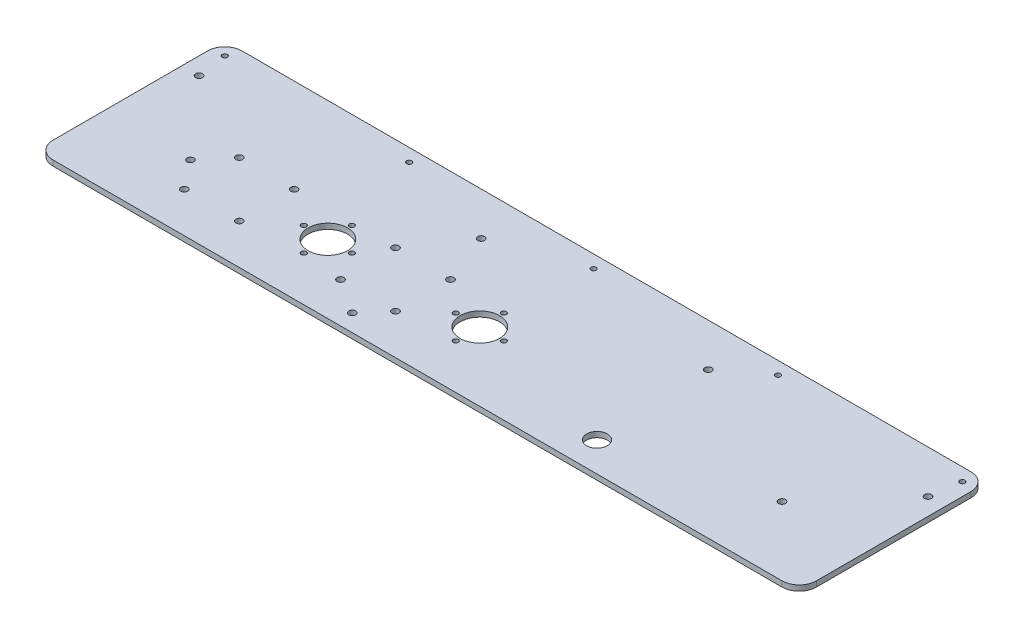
ISO-10303-21;
HEADER;
FILE_DESCRIPTION(('STEP AP214'),'2;1');
FILE_NAME('part.step','',(''),(''),'','','');
FILE_SCHEMA(('AUTOMOTIVE_DESIGN { 1 0 10303 214 1 1 1 1 }'));
ENDSEC;
DATA;
#1=APPLICATION_CONTEXT('core data for automotive mechanical design processes');
#2=APPLICATION_PROTOCOL_DEFINITION('international standard','automotive_design',2000,#1);
#3=PRODUCT_CONTEXT('',#1,'mechanical');
#4=PRODUCT('Part','Part','',(#3));
#5=PRODUCT_RELATED_PRODUCT_CATEGORY('part','',(#4));
#6=PRODUCT_DEFINITION_FORMATION('','',#4);
#7=PRODUCT_DEFINITION_CONTEXT('part definition',#1,'design');
#8=PRODUCT_DEFINITION('design','',#6,#7);
#9=PRODUCT_DEFINITION_SHAPE('','',#8);
#10=(LENGTH_UNIT() NAMED_UNIT(*) SI_UNIT(.MILLI.,.METRE.));
#11=(NAMED_UNIT(*) PLANE_ANGLE_UNIT() SI_UNIT($,.RADIAN.));
#12=(NAMED_UNIT(*) SI_UNIT($,.STERADIAN.) SOLID_ANGLE_UNIT());
#13=UNCERTAINTY_MEASURE_WITH_UNIT(LENGTH_MEASURE(1.E-05),#10,'distance_accuracy_value','');
#14=(GEOMETRIC_REPRESENTATION_CONTEXT(3) GLOBAL_UNCERTAINTY_ASSIGNED_CONTEXT((#13)) GLOBAL_UNIT_ASSIGNED_CONTEXT((#10,
#11,#12)) REPRESENTATION_CONTEXT('',''));
#15=CARTESIAN_POINT('',(0.,0.,0.));
#16=DIRECTION('',(0.,0.,1.));
#17=DIRECTION('',(1.,0.,0.));
#18=AXIS2_PLACEMENT_3D('',#15,#16,#17);
#19=CARTESIAN_POINT('',(417.700422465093,3.175,0.));
#20=DIRECTION('',(-1.,0.,0.));
#21=DIRECTION('',(0.,0.,1.));
#22=AXIS2_PLACEMENT_3D('',#19,#20,#21);
#23=PLANE('',#22);
#24=DIRECTION('',(0.,0.,-1.));
#25=VECTOR('',#24,1.);
#26=CARTESIAN_POINT('',(417.700422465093,0.,0.));
#27=LINE('',#26,#25);
#28=CARTESIAN_POINT('',(417.700422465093,0.,-10.));
#29=VERTEX_POINT('',#28);
#30=CARTESIAN_POINT('',(417.700422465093,0.,-100.));
#31=VERTEX_POINT('',#30);
#32=EDGE_CURVE('E124',#29,#31,#27,.T.);
#33=ORIENTED_EDGE('',*,*,#32,.T.);
#34=DIRECTION('',(0.,-1.,0.));
#35=VECTOR('',#34,1.);
#36=CARTESIAN_POINT('',(417.700422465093,3.175,-100.));
#37=LINE('',#36,#35);
#38=CARTESIAN_POINT('',(417.700422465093,3.175,-100.));
#39=VERTEX_POINT('',#38);
#40=EDGE_CURVE('E146',#31,#39,#37,.F.);
#41=ORIENTED_EDGE('',*,*,#40,.T.);
#42=DIRECTION('',(0.,0.,-1.));
#43=VECTOR('',#42,1.);
#44=CARTESIAN_POINT('',(417.700422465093,3.175,0.));
#45=LINE('',#44,#43);
#46=CARTESIAN_POINT('',(417.700422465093,3.175,-10.));
#47=VERTEX_POINT('',#46);
#48=EDGE_CURVE('E269',#47,#39,#45,.T.);
#49=ORIENTED_EDGE('',*,*,#48,.F.);
#50=DIRECTION('',(0.,-1.,0.));
#51=VECTOR('',#50,1.);
#52=CARTESIAN_POINT('',(417.700422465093,3.175,-10.));
#53=LINE('',#52,#51);
#54=EDGE_CURVE('E143',#47,#29,#53,.T.);
#55=ORIENTED_EDGE('',*,*,#54,.T.);
#56=EDGE_LOOP('',(#33,#41,#49,#55));
#57=FACE_BOUND('',#56,.T.);
#58=ADVANCED_FACE('F35',(#57),#23,.F.);
#59=CARTESIAN_POINT('',(0.,3.175,-110.));
#60=DIRECTION('',(0.,0.,-1.));
#61=DIRECTION('',(-1.,0.,0.));
#62=AXIS2_PLACEMENT_3D('',#59,#60,#61);
#63=PLANE('',#62);
#64=DIRECTION('',(1.,0.,0.));
#65=VECTOR('',#64,1.);
#66=CARTESIAN_POINT('',(0.,3.175,-110.));
#67=LINE('',#66,#65);
#68=CARTESIAN_POINT('',(-16.7995775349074,3.175,-110.));
#69=VERTEX_POINT('',#68);
#70=CARTESIAN_POINT('',(407.700422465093,3.175,-110.));
#71=VERTEX_POINT('',#70);
#72=EDGE_CURVE('E276',#69,#71,#67,.T.);
#73=ORIENTED_EDGE('',*,*,#72,.T.);
#74=DIRECTION('',(0.,-1.,0.));
#75=VECTOR('',#74,1.);
#76=CARTESIAN_POINT('',(407.700422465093,0.,-110.));
#77=LINE('',#76,#75);
#78=CARTESIAN_POINT('',(407.700422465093,0.,-110.));
#79=VERTEX_POINT('',#78);
#80=EDGE_CURVE('E115',#71,#79,#77,.T.);
#81=ORIENTED_EDGE('',*,*,#80,.T.);
#82=DIRECTION('',(1.,0.,0.));
#83=VECTOR('',#82,1.);
#84=CARTESIAN_POINT('',(0.,0.,-110.));
#85=LINE('',#84,#83);
#86=CARTESIAN_POINT('',(-16.7995775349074,0.,-110.));
#87=VERTEX_POINT('',#86);
#88=EDGE_CURVE('E107',#87,#79,#85,.T.);
#89=ORIENTED_EDGE('',*,*,#88,.F.);
#90=DIRECTION('',(0.,-1.,0.));
#91=VECTOR('',#90,1.);
#92=CARTESIAN_POINT('',(-16.7995775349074,3.175,-110.));
#93=LINE('',#92,#91);
#94=EDGE_CURVE('E121',#87,#69,#93,.F.);
#95=ORIENTED_EDGE('',*,*,#94,.T.);
#96=EDGE_LOOP('',(#73,#81,#89,#95));
#97=FACE_BOUND('',#96,.T.);
#98=ADVANCED_FACE('F120',(#97),#63,.T.);
#99=CARTESIAN_POINT('',(-26.7995775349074,3.175,0.));
#100=DIRECTION('',(-1.,0.,0.));
#101=DIRECTION('',(0.,0.,1.));
#102=AXIS2_PLACEMENT_3D('',#99,#100,#101);
#103=PLANE('',#102);
#104=DIRECTION('',(0.,0.,-1.));
#105=VECTOR('',#104,1.);
#106=CARTESIAN_POINT('',(-26.7995775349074,0.,0.));
#107=LINE('',#106,#105);
#108=CARTESIAN_POINT('',(-26.7995775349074,0.,-10.));
#109=VERTEX_POINT('',#108);
#110=CARTESIAN_POINT('',(-26.7995775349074,0.,-100.));
#111=VERTEX_POINT('',#110);
#112=EDGE_CURVE('E109',#109,#111,#107,.T.);
#113=ORIENTED_EDGE('',*,*,#112,.F.);
#114=DIRECTION('',(0.,-1.,0.));
#115=VECTOR('',#114,1.);
#116=CARTESIAN_POINT('',(-26.7995775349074,3.175,-10.));
#117=LINE('',#116,#115);
#118=CARTESIAN_POINT('',(-26.7995775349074,3.175,-10.));
#119=VERTEX_POINT('',#118);
#120=EDGE_CURVE('E11',#109,#119,#117,.F.);
#121=ORIENTED_EDGE('',*,*,#120,.T.);
#122=DIRECTION('',(0.,0.,-1.));
#123=VECTOR('',#122,1.);
#124=CARTESIAN_POINT('',(-26.7995775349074,3.175,0.));
#125=LINE('',#124,#123);
#126=CARTESIAN_POINT('',(-26.7995775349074,3.175,-100.));
#127=VERTEX_POINT('',#126);
#128=EDGE_CURVE('E278',#119,#127,#125,.T.);
#129=ORIENTED_EDGE('',*,*,#128,.T.);
#130=DIRECTION('',(0.,-1.,0.));
#131=VECTOR('',#130,1.);
#132=CARTESIAN_POINT('',(-26.7995775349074,3.175,-100.));
#133=LINE('',#132,#131);
#134=EDGE_CURVE('E44',#127,#111,#133,.T.);
#135=ORIENTED_EDGE('',*,*,#134,.T.);
#136=EDGE_LOOP('',(#113,#121,#129,#135));
#137=FACE_BOUND('',#136,.T.);
#138=ADVANCED_FACE('F370',(#137),#103,.T.);
#139=CARTESIAN_POINT('',(282.700422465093,3.175,-17.2281586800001));
#140=DIRECTION('',(0.,-1.,0.));
#141=DIRECTION('',(0.,0.,-1.));
#142=AXIS2_PLACEMENT_3D('',#139,#140,#141);
#143=CYLINDRICAL_SURFACE('',#142,5.99999999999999);
#144=CARTESIAN_POINT('',(282.700422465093,3.175,-17.2281586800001));
#145=DIRECTION('',(0.,1.,0.));
#146=DIRECTION('',(0.,0.,1.));
#147=AXIS2_PLACEMENT_3D('',#144,#145,#146);
#148=CIRCLE('',#147,5.99999999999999);
#149=CARTESIAN_POINT('',(282.700422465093,3.175,-11.2281586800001));
#150=VERTEX_POINT('',#149);
#151=EDGE_CURVE('E132',#150,#150,#148,.T.);
#152=ORIENTED_EDGE('',*,*,#151,.T.);
#153=EDGE_LOOP('',(#152));
#154=FACE_BOUND('',#153,.T.);
#155=CARTESIAN_POINT('',(282.700422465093,0.,-17.2281586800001));
#156=DIRECTION('',(0.,1.,0.));
#157=DIRECTION('',(0.,0.,1.));
#158=AXIS2_PLACEMENT_3D('',#155,#156,#157);
#159=CIRCLE('',#158,5.99999999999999);
#160=CARTESIAN_POINT('',(282.700422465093,0.,-11.2281586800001));
#161=VERTEX_POINT('',#160);
#162=EDGE_CURVE('E255',#161,#161,#159,.T.);
#163=ORIENTED_EDGE('',*,*,#162,.F.);
#164=EDGE_LOOP('',(#163));
#165=FACE_BOUND('',#164,.T.);
#166=ADVANCED_FACE('F342',(#154,#165),#143,.F.);
#167=CARTESIAN_POINT('',(103.200422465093,3.175,-40.));
#168=DIRECTION('',(0.,-1.,0.));
#169=DIRECTION('',(0.,0.,-1.));
#170=AXIS2_PLACEMENT_3D('',#167,#168,#169);
#171=CYLINDRICAL_SURFACE('',#170,11.5);
#172=CARTESIAN_POINT('',(103.200422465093,3.175,-40.));
#173=DIRECTION('',(0.,1.,0.));
#174=DIRECTION('',(0.,0.,1.));
#175=AXIS2_PLACEMENT_3D('',#172,#173,#174);
#176=CIRCLE('',#175,11.5);
#177=CARTESIAN_POINT('',(103.200422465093,3.175,-28.5));
#178=VERTEX_POINT('',#177);
#179=EDGE_CURVE('E337',#178,#178,#176,.T.);
#180=ORIENTED_EDGE('',*,*,#179,.T.);
#181=EDGE_LOOP('',(#180));
#182=FACE_BOUND('',#181,.T.);
#183=CARTESIAN_POINT('',(103.200422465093,0.,-40.));
#184=DIRECTION('',(0.,1.,0.));
#185=DIRECTION('',(0.,0.,1.));
#186=AXIS2_PLACEMENT_3D('',#183,#184,#185);
#187=CIRCLE('',#186,11.5);
#188=CARTESIAN_POINT('',(103.200422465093,0.,-28.5));
#189=VERTEX_POINT('',#188);
#190=EDGE_CURVE('E253',#189,#189,#187,.T.);
#191=ORIENTED_EDGE('',*,*,#190,.F.);
#192=EDGE_LOOP('',(#191));
#193=FACE_BOUND('',#192,.T.);
#194=ADVANCED_FACE('F407',(#182,#193),#171,.F.);
#195=CARTESIAN_POINT('',(103.200422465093,3.175,-26.));
#196=DIRECTION('',(0.,-1.,0.));
#197=DIRECTION('',(0.,0.,-1.));
#198=AXIS2_PLACEMENT_3D('',#195,#196,#197);
#199=CYLINDRICAL_SURFACE('',#198,1.5);
#200=CARTESIAN_POINT('',(103.200422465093,3.175,-26.));
#201=DIRECTION('',(0.,1.,0.));
#202=DIRECTION('',(0.,0.,1.));
#203=AXIS2_PLACEMENT_3D('',#200,#201,#202);
#204=CIRCLE('',#203,1.5);
#205=CARTESIAN_POINT('',(103.200422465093,3.175,-24.5));
#206=VERTEX_POINT('',#205);
#207=EDGE_CURVE('E334',#206,#206,#204,.T.);
#208=ORIENTED_EDGE('',*,*,#207,.T.);
#209=EDGE_LOOP('',(#208));
#210=FACE_BOUND('',#209,.T.);
#211=CARTESIAN_POINT('',(103.200422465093,0.,-26.));
#212=DIRECTION('',(0.,1.,0.));
#213=DIRECTION('',(0.,0.,1.));
#214=AXIS2_PLACEMENT_3D('',#211,#212,#213);
#215=CIRCLE('',#214,1.5);
#216=CARTESIAN_POINT('',(103.200422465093,0.,-24.5));
#217=VERTEX_POINT('',#216);
#218=EDGE_CURVE('E250',#217,#217,#215,.T.);
#219=ORIENTED_EDGE('',*,*,#218,.F.);
#220=EDGE_LOOP('',(#219));
#221=FACE_BOUND('',#220,.T.);
#222=ADVANCED_FACE('F478',(#210,#221),#199,.F.);
#223=CARTESIAN_POINT('',(23.2004224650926,3.175,-40.));
#224=DIRECTION('',(0.,-1.,0.));
#225=DIRECTION('',(0.,0.,-1.));
#226=AXIS2_PLACEMENT_3D('',#223,#224,#225);
#227=CYLINDRICAL_SURFACE('',#226,2.);
#228=CARTESIAN_POINT('',(23.2004224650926,3.175,-40.));
#229=DIRECTION('',(0.,1.,0.));
#230=DIRECTION('',(0.,0.,1.));
#231=AXIS2_PLACEMENT_3D('',#228,#229,#230);
#232=CIRCLE('',#231,2.);
#233=CARTESIAN_POINT('',(23.2004224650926,3.175,-38.));
#234=VERTEX_POINT('',#233);
#235=EDGE_CURVE('E331',#234,#234,#232,.T.);
#236=ORIENTED_EDGE('',*,*,#235,.T.);
#237=EDGE_LOOP('',(#236));
#238=FACE_BOUND('',#237,.T.);
#239=CARTESIAN_POINT('',(23.2004224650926,0.,-40.));
#240=DIRECTION('',(0.,1.,0.));
#241=DIRECTION('',(0.,0.,1.));
#242=AXIS2_PLACEMENT_3D('',#239,#240,#241);
#243=CIRCLE('',#242,2.);
#244=CARTESIAN_POINT('',(23.2004224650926,0.,-38.));
#245=VERTEX_POINT('',#244);
#246=EDGE_CURVE('E247',#245,#245,#243,.T.);
#247=ORIENTED_EDGE('',*,*,#246,.F.);
#248=EDGE_LOOP('',(#247));
#249=FACE_BOUND('',#248,.T.);
#250=ADVANCED_FACE('F474',(#238,#249),#227,.F.);
#251=CARTESIAN_POINT('',(117.200422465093,3.175,-40.));
#252=DIRECTION('',(0.,-1.,0.));
#253=DIRECTION('',(0.,0.,-1.));
#254=AXIS2_PLACEMENT_3D('',#251,#252,#253);
#255=CYLINDRICAL_SURFACE('',#254,1.5);
#256=CARTESIAN_POINT('',(117.200422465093,3.175,-40.));
#257=DIRECTION('',(0.,1.,0.));
#258=DIRECTION('',(0.,0.,1.));
#259=AXIS2_PLACEMENT_3D('',#256,#257,#258);
#260=CIRCLE('',#259,1.5);
#261=CARTESIAN_POINT('',(117.200422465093,3.175,-38.5));
#262=VERTEX_POINT('',#261);
#263=EDGE_CURVE('E328',#262,#262,#260,.T.);
#264=ORIENTED_EDGE('',*,*,#263,.T.);
#265=EDGE_LOOP('',(#264));
#266=FACE_BOUND('',#265,.T.);
#267=CARTESIAN_POINT('',(117.200422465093,0.,-40.));
#268=DIRECTION('',(0.,1.,0.));
#269=DIRECTION('',(0.,0.,1.));
#270=AXIS2_PLACEMENT_3D('',#267,#268,#269);
#271=CIRCLE('',#270,1.5);
#272=CARTESIAN_POINT('',(117.200422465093,0.,-38.5));
#273=VERTEX_POINT('',#272);
#274=EDGE_CURVE('E244',#273,#273,#271,.T.);
#275=ORIENTED_EDGE('',*,*,#274,.F.);
#276=EDGE_LOOP('',(#275));
#277=FACE_BOUND('',#276,.T.);
#278=ADVANCED_FACE('F470',(#266,#277),#255,.F.);
#279=CARTESIAN_POINT('',(191.700422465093,3.175,-26.));
#280=DIRECTION('',(0.,-1.,0.));
#281=DIRECTION('',(0.,0.,-1.));
#282=AXIS2_PLACEMENT_3D('',#279,#280,#281);
#283=CYLINDRICAL_SURFACE('',#282,1.5);
#284=CARTESIAN_POINT('',(191.700422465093,3.175,-26.));
#285=DIRECTION('',(0.,1.,0.));
#286=DIRECTION('',(0.,0.,1.));
#287=AXIS2_PLACEMENT_3D('',#284,#285,#286);
#288=CIRCLE('',#287,1.5);
#289=CARTESIAN_POINT('',(191.700422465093,3.175,-24.5));
#290=VERTEX_POINT('',#289);
#291=EDGE_CURVE('E325',#290,#290,#288,.T.);
#292=ORIENTED_EDGE('',*,*,#291,.T.);
#293=EDGE_LOOP('',(#292));
#294=FACE_BOUND('',#293,.T.);
#295=CARTESIAN_POINT('',(191.700422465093,0.,-26.));
#296=DIRECTION('',(0.,1.,0.));
#297=DIRECTION('',(0.,0.,1.));
#298=AXIS2_PLACEMENT_3D('',#295,#296,#297);
#299=CIRCLE('',#298,1.5);
#300=CARTESIAN_POINT('',(191.700422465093,0.,-24.5));
#301=VERTEX_POINT('',#300);
#302=EDGE_CURVE('E241',#301,#301,#299,.T.);
#303=ORIENTED_EDGE('',*,*,#302,.F.);
#304=EDGE_LOOP('',(#303));
#305=FACE_BOUND('',#304,.T.);
#306=ADVANCED_FACE('F466',(#294,#305),#283,.F.);
#307=CARTESIAN_POINT('',(191.700422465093,3.175,-54.));
#308=DIRECTION('',(0.,-1.,0.));
#309=DIRECTION('',(0.,0.,-1.));
#310=AXIS2_PLACEMENT_3D('',#307,#308,#309);
#311=CYLINDRICAL_SURFACE('',#310,1.5);
#312=CARTESIAN_POINT('',(191.700422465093,3.175,-54.));
#313=DIRECTION('',(0.,1.,0.));
#314=DIRECTION('',(0.,0.,1.));
#315=AXIS2_PLACEMENT_3D('',#312,#313,#314);
#316=CIRCLE('',#315,1.5);
#317=CARTESIAN_POINT('',(191.700422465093,3.175,-52.5));
#318=VERTEX_POINT('',#317);
#319=EDGE_CURVE('E322',#318,#318,#316,.T.);
#320=ORIENTED_EDGE('',*,*,#319,.T.);
#321=EDGE_LOOP('',(#320));
#322=FACE_BOUND('',#321,.T.);
#323=CARTESIAN_POINT('',(191.700422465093,0.,-54.));
#324=DIRECTION('',(0.,1.,0.));
#325=DIRECTION('',(0.,0.,1.));
#326=AXIS2_PLACEMENT_3D('',#323,#324,#325);
#327=CIRCLE('',#326,1.5);
#328=CARTESIAN_POINT('',(191.700422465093,0.,-52.5));
#329=VERTEX_POINT('',#328);
#330=EDGE_CURVE('E238',#329,#329,#327,.T.);
#331=ORIENTED_EDGE('',*,*,#330,.F.);
#332=EDGE_LOOP('',(#331));
#333=FACE_BOUND('',#332,.T.);
#334=ADVANCED_FACE('F462',(#322,#333),#311,.F.);
#335=CARTESIAN_POINT('',(367.700422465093,3.175,-40.));
#336=DIRECTION('',(0.,-1.,0.));
#337=DIRECTION('',(0.,0.,-1.));
#338=AXIS2_PLACEMENT_3D('',#335,#336,#337);
#339=CYLINDRICAL_SURFACE('',#338,2.);
#340=CARTESIAN_POINT('',(367.700422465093,3.175,-40.));
#341=DIRECTION('',(0.,1.,0.));
#342=DIRECTION('',(0.,0.,1.));
#343=AXIS2_PLACEMENT_3D('',#340,#341,#342);
#344=CIRCLE('',#343,2.);
#345=CARTESIAN_POINT('',(367.700422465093,3.175,-38.));
#346=VERTEX_POINT('',#345);
#347=EDGE_CURVE('E319',#346,#346,#344,.T.);
#348=ORIENTED_EDGE('',*,*,#347,.T.);
#349=EDGE_LOOP('',(#348));
#350=FACE_BOUND('',#349,.T.);
#351=CARTESIAN_POINT('',(367.700422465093,0.,-40.));
#352=DIRECTION('',(0.,1.,0.));
#353=DIRECTION('',(0.,0.,1.));
#354=AXIS2_PLACEMENT_3D('',#351,#352,#353);
#355=CIRCLE('',#354,2.);
#356=CARTESIAN_POINT('',(367.700422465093,0.,-38.));
#357=VERTEX_POINT('',#356);
#358=EDGE_CURVE('E235',#357,#357,#355,.T.);
#359=ORIENTED_EDGE('',*,*,#358,.F.);
#360=EDGE_LOOP('',(#359));
#361=FACE_BOUND('',#360,.T.);
#362=ADVANCED_FACE('F458',(#350,#361),#339,.F.);
#363=CARTESIAN_POINT('',(89.2004224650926,3.175,-40.));
#364=DIRECTION('',(0.,-1.,0.));
#365=DIRECTION('',(0.,0.,-1.));
#366=AXIS2_PLACEMENT_3D('',#363,#364,#365);
#367=CYLINDRICAL_SURFACE('',#366,1.5);
#368=CARTESIAN_POINT('',(89.2004224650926,3.175,-40.));
#369=DIRECTION('',(0.,1.,0.));
#370=DIRECTION('',(0.,0.,1.));
#371=AXIS2_PLACEMENT_3D('',#368,#369,#370);
#372=CIRCLE('',#371,1.5);
#373=CARTESIAN_POINT('',(89.2004224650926,3.175,-38.5));
#374=VERTEX_POINT('',#373);
#375=EDGE_CURVE('E316',#374,#374,#372,.T.);
#376=ORIENTED_EDGE('',*,*,#375,.T.);
#377=EDGE_LOOP('',(#376));
#378=FACE_BOUND('',#377,.T.);
#379=CARTESIAN_POINT('',(89.2004224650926,0.,-40.));
#380=DIRECTION('',(0.,1.,0.));
#381=DIRECTION('',(0.,0.,1.));
#382=AXIS2_PLACEMENT_3D('',#379,#380,#381);
#383=CIRCLE('',#382,1.5);
#384=CARTESIAN_POINT('',(89.2004224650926,0.,-38.5));
#385=VERTEX_POINT('',#384);
#386=EDGE_CURVE('E232',#385,#385,#383,.T.);
#387=ORIENTED_EDGE('',*,*,#386,.F.);
#388=EDGE_LOOP('',(#387));
#389=FACE_BOUND('',#388,.T.);
#390=ADVANCED_FACE('F454',(#378,#389),#367,.F.);
#391=CARTESIAN_POINT('',(103.200422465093,3.175,-54.));
#392=DIRECTION('',(0.,-1.,0.));
#393=DIRECTION('',(0.,0.,-1.));
#394=AXIS2_PLACEMENT_3D('',#391,#392,#393);
#395=CYLINDRICAL_SURFACE('',#394,1.5);
#396=CARTESIAN_POINT('',(103.200422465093,3.175,-54.));
#397=DIRECTION('',(0.,1.,0.));
#398=DIRECTION('',(0.,0.,1.));
#399=AXIS2_PLACEMENT_3D('',#396,#397,#398);
#400=CIRCLE('',#399,1.5);
#401=CARTESIAN_POINT('',(103.200422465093,3.175,-52.5));
#402=VERTEX_POINT('',#401);
#403=EDGE_CURVE('E313',#402,#402,#400,.T.);
#404=ORIENTED_EDGE('',*,*,#403,.T.);
#405=EDGE_LOOP('',(#404));
#406=FACE_BOUND('',#405,.T.);
#407=CARTESIAN_POINT('',(103.200422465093,0.,-54.));
#408=DIRECTION('',(0.,1.,0.));
#409=DIRECTION('',(0.,0.,1.));
#410=AXIS2_PLACEMENT_3D('',#407,#408,#409);
#411=CIRCLE('',#410,1.5);
#412=CARTESIAN_POINT('',(103.200422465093,0.,-52.5));
#413=VERTEX_POINT('',#412);
#414=EDGE_CURVE('E229',#413,#413,#411,.T.);
#415=ORIENTED_EDGE('',*,*,#414,.F.);
#416=EDGE_LOOP('',(#415));
#417=FACE_BOUND('',#416,.T.);
#418=ADVANCED_FACE('F450',(#406,#417),#395,.F.);
#419=CARTESIAN_POINT('',(-16.7995775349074,3.175,-85.));
#420=DIRECTION('',(0.,-1.,0.));
#421=DIRECTION('',(0.,0.,-1.));
#422=AXIS2_PLACEMENT_3D('',#419,#420,#421);
#423=CYLINDRICAL_SURFACE('',#422,2.);
#424=CARTESIAN_POINT('',(-16.7995775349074,3.175,-85.));
#425=DIRECTION('',(0.,1.,0.));
#426=DIRECTION('',(0.,0.,1.));
#427=AXIS2_PLACEMENT_3D('',#424,#425,#426);
#428=CIRCLE('',#427,2.);
#429=CARTESIAN_POINT('',(-16.7995775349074,3.175,-83.));
#430=VERTEX_POINT('',#429);
#431=EDGE_CURVE('E310',#430,#430,#428,.T.);
#432=ORIENTED_EDGE('',*,*,#431,.T.);
#433=EDGE_LOOP('',(#432));
#434=FACE_BOUND('',#433,.T.);
#435=CARTESIAN_POINT('',(-16.7995775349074,0.,-85.));
#436=DIRECTION('',(0.,1.,0.));
#437=DIRECTION('',(0.,0.,1.));
#438=AXIS2_PLACEMENT_3D('',#435,#436,#437);
#439=CIRCLE('',#438,2.);
#440=CARTESIAN_POINT('',(-16.7995775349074,0.,-83.));
#441=VERTEX_POINT('',#440);
#442=EDGE_CURVE('E226',#441,#441,#439,.T.);
#443=ORIENTED_EDGE('',*,*,#442,.F.);
#444=EDGE_LOOP('',(#443));
#445=FACE_BOUND('',#444,.T.);
#446=ADVANCED_FACE('F446',(#434,#445),#423,.F.);
#447=CARTESIAN_POINT('',(147.450422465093,3.175,-85.));
#448=DIRECTION('',(0.,-1.,0.));
#449=DIRECTION('',(0.,0.,-1.));
#450=AXIS2_PLACEMENT_3D('',#447,#448,#449);
#451=CYLINDRICAL_SURFACE('',#450,2.);
#452=CARTESIAN_POINT('',(147.450422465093,3.175,-85.));
#453=DIRECTION('',(0.,1.,0.));
#454=DIRECTION('',(0.,0.,1.));
#455=AXIS2_PLACEMENT_3D('',#452,#453,#454);
#456=CIRCLE('',#455,2.);
#457=CARTESIAN_POINT('',(147.450422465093,3.175,-83.));
#458=VERTEX_POINT('',#457);
#459=EDGE_CURVE('E307',#458,#458,#456,.T.);
#460=ORIENTED_EDGE('',*,*,#459,.T.);
#461=EDGE_LOOP('',(#460));
#462=FACE_BOUND('',#461,.T.);
#463=CARTESIAN_POINT('',(147.450422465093,0.,-85.));
#464=DIRECTION('',(0.,1.,0.));
#465=DIRECTION('',(0.,0.,1.));
#466=AXIS2_PLACEMENT_3D('',#463,#464,#465);
#467=CIRCLE('',#466,2.);
#468=CARTESIAN_POINT('',(147.450422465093,0.,-83.));
#469=VERTEX_POINT('',#468);
#470=EDGE_CURVE('E223',#469,#469,#467,.T.);
#471=ORIENTED_EDGE('',*,*,#470,.F.);
#472=EDGE_LOOP('',(#471));
#473=FACE_BOUND('',#472,.T.);
#474=ADVANCED_FACE('F442',(#462,#473),#451,.F.);
#475=CARTESIAN_POINT('',(177.700422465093,3.175,-40.));
#476=DIRECTION('',(0.,-1.,0.));
#477=DIRECTION('',(0.,0.,-1.));
#478=AXIS2_PLACEMENT_3D('',#475,#476,#477);
#479=CYLINDRICAL_SURFACE('',#478,1.5);
#480=CARTESIAN_POINT('',(177.700422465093,3.175,-40.));
#481=DIRECTION('',(0.,1.,0.));
#482=DIRECTION('',(0.,0.,1.));
#483=AXIS2_PLACEMENT_3D('',#480,#481,#482);
#484=CIRCLE('',#483,1.5);
#485=CARTESIAN_POINT('',(177.700422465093,3.175,-38.5));
#486=VERTEX_POINT('',#485);
#487=EDGE_CURVE('E304',#486,#486,#484,.T.);
#488=ORIENTED_EDGE('',*,*,#487,.T.);
#489=EDGE_LOOP('',(#488));
#490=FACE_BOUND('',#489,.T.);
#491=CARTESIAN_POINT('',(177.700422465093,0.,-40.));
#492=DIRECTION('',(0.,1.,0.));
#493=DIRECTION('',(0.,0.,1.));
#494=AXIS2_PLACEMENT_3D('',#491,#492,#493);
#495=CIRCLE('',#494,1.5);
#496=CARTESIAN_POINT('',(177.700422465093,0.,-38.5));
#497=VERTEX_POINT('',#496);
#498=EDGE_CURVE('E220',#497,#497,#495,.T.);
#499=ORIENTED_EDGE('',*,*,#498,.F.);
#500=EDGE_LOOP('',(#499));
#501=FACE_BOUND('',#500,.T.);
#502=ADVANCED_FACE('F438',(#490,#501),#479,.F.);
#503=CARTESIAN_POINT('',(279.700422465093,3.175,-85.));
#504=DIRECTION('',(0.,-1.,0.));
#505=DIRECTION('',(0.,0.,-1.));
#506=AXIS2_PLACEMENT_3D('',#503,#504,#505);
#507=CYLINDRICAL_SURFACE('',#506,2.);
#508=CARTESIAN_POINT('',(279.700422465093,3.175,-85.));
#509=DIRECTION('',(0.,1.,0.));
#510=DIRECTION('',(0.,0.,1.));
#511=AXIS2_PLACEMENT_3D('',#508,#509,#510);
#512=CIRCLE('',#511,2.);
#513=CARTESIAN_POINT('',(279.700422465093,3.175,-83.));
#514=VERTEX_POINT('',#513);
#515=EDGE_CURVE('E301',#514,#514,#512,.T.);
#516=ORIENTED_EDGE('',*,*,#515,.T.);
#517=EDGE_LOOP('',(#516));
#518=FACE_BOUND('',#517,.T.);
#519=CARTESIAN_POINT('',(279.700422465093,0.,-85.));
#520=DIRECTION('',(0.,1.,0.));
#521=DIRECTION('',(0.,0.,1.));
#522=AXIS2_PLACEMENT_3D('',#519,#520,#521);
#523=CIRCLE('',#522,2.);
#524=CARTESIAN_POINT('',(279.700422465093,0.,-83.));
#525=VERTEX_POINT('',#524);
#526=EDGE_CURVE('E217',#525,#525,#523,.T.);
#527=ORIENTED_EDGE('',*,*,#526,.F.);
#528=EDGE_LOOP('',(#527));
#529=FACE_BOUND('',#528,.T.);
#530=ADVANCED_FACE('F434',(#518,#529),#507,.F.);
#531=CARTESIAN_POINT('',(205.700422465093,3.175,-40.));
#532=DIRECTION('',(0.,-1.,0.));
#533=DIRECTION('',(0.,0.,-1.));
#534=AXIS2_PLACEMENT_3D('',#531,#532,#533);
#535=CYLINDRICAL_SURFACE('',#534,1.5);
#536=CARTESIAN_POINT('',(205.700422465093,3.175,-40.));
#537=DIRECTION('',(0.,1.,0.));
#538=DIRECTION('',(0.,0.,1.));
#539=AXIS2_PLACEMENT_3D('',#536,#537,#538);
#540=CIRCLE('',#539,1.5);
#541=CARTESIAN_POINT('',(205.700422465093,3.175,-38.5));
#542=VERTEX_POINT('',#541);
#543=EDGE_CURVE('E298',#542,#542,#540,.T.);
#544=ORIENTED_EDGE('',*,*,#543,.T.);
#545=EDGE_LOOP('',(#544));
#546=FACE_BOUND('',#545,.T.);
#547=CARTESIAN_POINT('',(205.700422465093,0.,-40.));
#548=DIRECTION('',(0.,1.,0.));
#549=DIRECTION('',(0.,0.,1.));
#550=AXIS2_PLACEMENT_3D('',#547,#548,#549);
#551=CIRCLE('',#550,1.5);
#552=CARTESIAN_POINT('',(205.700422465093,0.,-38.5));
#553=VERTEX_POINT('',#552);
#554=EDGE_CURVE('E214',#553,#553,#551,.T.);
#555=ORIENTED_EDGE('',*,*,#554,.F.);
#556=EDGE_LOOP('',(#555));
#557=FACE_BOUND('',#556,.T.);
#558=ADVANCED_FACE('F430',(#546,#557),#535,.F.);
#559=CARTESIAN_POINT('',(191.700422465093,3.175,-40.));
#560=DIRECTION('',(0.,-1.,0.));
#561=DIRECTION('',(0.,0.,-1.));
#562=AXIS2_PLACEMENT_3D('',#559,#560,#561);
#563=CYLINDRICAL_SURFACE('',#562,11.5);
#564=CARTESIAN_POINT('',(191.700422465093,3.175,-40.));
#565=DIRECTION('',(0.,1.,0.));
#566=DIRECTION('',(0.,0.,1.));
#567=AXIS2_PLACEMENT_3D('',#564,#565,#566);
#568=CIRCLE('',#567,11.5);
#569=CARTESIAN_POINT('',(191.700422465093,3.175,-28.5));
#570=VERTEX_POINT('',#569);
#571=EDGE_CURVE('E295',#570,#570,#568,.T.);
#572=ORIENTED_EDGE('',*,*,#571,.T.);
#573=EDGE_LOOP('',(#572));
#574=FACE_BOUND('',#573,.T.);
#575=CARTESIAN_POINT('',(191.700422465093,0.,-40.));
#576=DIRECTION('',(0.,1.,0.));
#577=DIRECTION('',(0.,0.,1.));
#578=AXIS2_PLACEMENT_3D('',#575,#576,#577);
#579=CIRCLE('',#578,11.5);
#580=CARTESIAN_POINT('',(191.700422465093,0.,-28.5));
#581=VERTEX_POINT('',#580);
#582=EDGE_CURVE('E211',#581,#581,#579,.T.);
#583=ORIENTED_EDGE('',*,*,#582,.F.);
#584=EDGE_LOOP('',(#583));
#585=FACE_BOUND('',#584,.T.);
#586=ADVANCED_FACE('F426',(#574,#585),#563,.F.);
#587=CARTESIAN_POINT('',(407.700422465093,3.175,-85.));
#588=DIRECTION('',(0.,-1.,0.));
#589=DIRECTION('',(0.,0.,-1.));
#590=AXIS2_PLACEMENT_3D('',#587,#588,#589);
#591=CYLINDRICAL_SURFACE('',#590,2.);
#592=CARTESIAN_POINT('',(407.700422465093,3.175,-85.));
#593=DIRECTION('',(0.,1.,0.));
#594=DIRECTION('',(0.,0.,1.));
#595=AXIS2_PLACEMENT_3D('',#592,#593,#594);
#596=CIRCLE('',#595,2.);
#597=CARTESIAN_POINT('',(407.700422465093,3.175,-83.));
#598=VERTEX_POINT('',#597);
#599=EDGE_CURVE('E292',#598,#598,#596,.T.);
#600=ORIENTED_EDGE('',*,*,#599,.T.);
#601=EDGE_LOOP('',(#600));
#602=FACE_BOUND('',#601,.T.);
#603=CARTESIAN_POINT('',(407.700422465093,0.,-85.));
#604=DIRECTION('',(0.,1.,0.));
#605=DIRECTION('',(0.,0.,1.));
#606=AXIS2_PLACEMENT_3D('',#603,#604,#605);
#607=CIRCLE('',#606,2.);
#608=CARTESIAN_POINT('',(407.700422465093,0.,-83.));
#609=VERTEX_POINT('',#608);
#610=EDGE_CURVE('E208',#609,#609,#607,.T.);
#611=ORIENTED_EDGE('',*,*,#610,.F.);
#612=EDGE_LOOP('',(#611));
#613=FACE_BOUND('',#612,.T.);
#614=ADVANCED_FACE('F422',(#602,#613),#591,.F.);
#615=CARTESIAN_POINT('',(195.450422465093,3.175,-102.5));
#616=DIRECTION('',(0.,-1.,0.));
#617=DIRECTION('',(0.,0.,-1.));
#618=AXIS2_PLACEMENT_3D('',#615,#616,#617);
#619=CYLINDRICAL_SURFACE('',#618,1.5);
#620=CARTESIAN_POINT('',(195.450422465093,3.175,-102.5));
#621=DIRECTION('',(0.,1.,0.));
#622=DIRECTION('',(0.,0.,1.));
#623=AXIS2_PLACEMENT_3D('',#620,#621,#622);
#624=CIRCLE('',#623,1.5);
#625=CARTESIAN_POINT('',(195.450422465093,3.175,-101.));
#626=VERTEX_POINT('',#625);
#627=EDGE_CURVE('E289',#626,#626,#624,.T.);
#628=ORIENTED_EDGE('',*,*,#627,.T.);
#629=EDGE_LOOP('',(#628));
#630=FACE_BOUND('',#629,.T.);
#631=CARTESIAN_POINT('',(195.450422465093,0.,-102.5));
#632=DIRECTION('',(0.,1.,0.));
#633=DIRECTION('',(0.,0.,1.));
#634=AXIS2_PLACEMENT_3D('',#631,#632,#633);
#635=CIRCLE('',#634,1.5);
#636=CARTESIAN_POINT('',(195.450422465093,0.,-101.));
#637=VERTEX_POINT('',#636);
#638=EDGE_CURVE('E205',#637,#637,#635,.T.);
#639=ORIENTED_EDGE('',*,*,#638,.F.);
#640=EDGE_LOOP('',(#639));
#641=FACE_BOUND('',#640,.T.);
#642=ADVANCED_FACE('F418',(#630,#641),#619,.F.);
#643=CARTESIAN_POINT('',(302.825422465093,3.175,-102.5));
#644=DIRECTION('',(0.,-1.,0.));
#645=DIRECTION('',(0.,0.,-1.));
#646=AXIS2_PLACEMENT_3D('',#643,#644,#645);
#647=CYLINDRICAL_SURFACE('',#646,1.50000000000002);
#648=CARTESIAN_POINT('',(302.825422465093,3.175,-102.5));
#649=DIRECTION('',(0.,1.,0.));
#650=DIRECTION('',(0.,0.,1.));
#651=AXIS2_PLACEMENT_3D('',#648,#649,#650);
#652=CIRCLE('',#651,1.50000000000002);
#653=CARTESIAN_POINT('',(302.825422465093,3.175,-101.));
#654=VERTEX_POINT('',#653);
#655=EDGE_CURVE('E286',#654,#654,#652,.T.);
#656=ORIENTED_EDGE('',*,*,#655,.T.);
#657=EDGE_LOOP('',(#656));
#658=FACE_BOUND('',#657,.T.);
#659=CARTESIAN_POINT('',(302.825422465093,0.,-102.5));
#660=DIRECTION('',(0.,1.,0.));
#661=DIRECTION('',(0.,0.,1.));
#662=AXIS2_PLACEMENT_3D('',#659,#660,#661);
#663=CIRCLE('',#662,1.50000000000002);
#664=CARTESIAN_POINT('',(302.825422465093,0.,-101.));
#665=VERTEX_POINT('',#664);
#666=EDGE_CURVE('E202',#665,#665,#663,.T.);
#667=ORIENTED_EDGE('',*,*,#666,.F.);
#668=EDGE_LOOP('',(#667));
#669=FACE_BOUND('',#668,.T.);
#670=ADVANCED_FACE('F414',(#658,#669),#647,.F.);
#671=CARTESIAN_POINT('',(410.200422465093,3.175,-102.5));
#672=DIRECTION('',(0.,-1.,0.));
#673=DIRECTION('',(0.,0.,-1.));
#674=AXIS2_PLACEMENT_3D('',#671,#672,#673);
#675=CYLINDRICAL_SURFACE('',#674,1.50000000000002);
#676=CARTESIAN_POINT('',(410.200422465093,3.175,-102.5));
#677=DIRECTION('',(0.,1.,0.));
#678=DIRECTION('',(0.,0.,1.));
#679=AXIS2_PLACEMENT_3D('',#676,#677,#678);
#680=CIRCLE('',#679,1.50000000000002);
#681=CARTESIAN_POINT('',(410.200422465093,3.175,-101.));
#682=VERTEX_POINT('',#681);
#683=EDGE_CURVE('E283',#682,#682,#680,.T.);
#684=ORIENTED_EDGE('',*,*,#683,.T.);
#685=EDGE_LOOP('',(#684));
#686=FACE_BOUND('',#685,.T.);
#687=CARTESIAN_POINT('',(410.200422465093,0.,-102.5));
#688=DIRECTION('',(0.,1.,0.));
#689=DIRECTION('',(0.,0.,1.));
#690=AXIS2_PLACEMENT_3D('',#687,#688,#689);
#691=CIRCLE('',#690,1.50000000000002);
#692=CARTESIAN_POINT('',(410.200422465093,0.,-101.));
#693=VERTEX_POINT('',#692);
#694=EDGE_CURVE('E199',#693,#693,#691,.T.);
#695=ORIENTED_EDGE('',*,*,#694,.F.);
#696=EDGE_LOOP('',(#695));
#697=FACE_BOUND('',#696,.T.);
#698=ADVANCED_FACE('F411',(#686,#697),#675,.F.);
#699=CARTESIAN_POINT('',(0.,3.175,0.));
#700=DIRECTION('',(0.,0.,-1.));
#701=DIRECTION('',(-1.,0.,0.));
#702=AXIS2_PLACEMENT_3D('',#699,#700,#701);
#703=PLANE('',#702);
#704=DIRECTION('',(1.,0.,0.));
#705=VECTOR('',#704,1.);
#706=CARTESIAN_POINT('',(0.,0.,0.));
#707=LINE('',#706,#705);
#708=CARTESIAN_POINT('',(-16.7995775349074,0.,0.));
#709=VERTEX_POINT('',#708);
#710=CARTESIAN_POINT('',(407.700422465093,0.,0.));
#711=VERTEX_POINT('',#710);
#712=EDGE_CURVE('E197',#709,#711,#707,.T.);
#713=ORIENTED_EDGE('',*,*,#712,.T.);
#714=DIRECTION('',(0.,-1.,0.));
#715=VECTOR('',#714,1.);
#716=CARTESIAN_POINT('',(407.700422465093,3.175,0.));
#717=LINE('',#716,#715);
#718=CARTESIAN_POINT('',(407.700422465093,3.175,0.));
#719=VERTEX_POINT('',#718);
#720=EDGE_CURVE('E52',#711,#719,#717,.F.);
#721=ORIENTED_EDGE('',*,*,#720,.T.);
#722=DIRECTION('',(1.,0.,0.));
#723=VECTOR('',#722,1.);
#724=CARTESIAN_POINT('',(0.,3.175,0.));
#725=LINE('',#724,#723);
#726=CARTESIAN_POINT('',(-16.7995775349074,3.175,0.));
#727=VERTEX_POINT('',#726);
#728=EDGE_CURVE('E281',#727,#719,#725,.T.);
#729=ORIENTED_EDGE('',*,*,#728,.F.);
#730=DIRECTION('',(0.,-1.,0.));
#731=VECTOR('',#730,1.);
#732=CARTESIAN_POINT('',(-16.7995775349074,0.,0.));
#733=LINE('',#732,#731);
#734=EDGE_CURVE('E154',#727,#709,#733,.T.);
#735=ORIENTED_EDGE('',*,*,#734,.T.);
#736=EDGE_LOOP('',(#713,#721,#729,#735));
#737=FACE_BOUND('',#736,.T.);
#738=ADVANCED_FACE('F375',(#737),#703,.F.);
#739=CARTESIAN_POINT('',(-19.2995775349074,3.175,-102.5));
#740=DIRECTION('',(0.,-1.,0.));
#741=DIRECTION('',(0.,0.,-1.));
#742=AXIS2_PLACEMENT_3D('',#739,#740,#741);
#743=CYLINDRICAL_SURFACE('',#742,1.5);
#744=CARTESIAN_POINT('',(-19.2995775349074,3.175,-102.5));
#745=DIRECTION('',(0.,1.,0.));
#746=DIRECTION('',(0.,0.,1.));
#747=AXIS2_PLACEMENT_3D('',#744,#745,#746);
#748=CIRCLE('',#747,1.5);
#749=CARTESIAN_POINT('',(-19.2995775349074,3.175,-101.));
#750=VERTEX_POINT('',#749);
#751=EDGE_CURVE('E264',#750,#750,#748,.T.);
#752=ORIENTED_EDGE('',*,*,#751,.T.);
#753=EDGE_LOOP('',(#752));
#754=FACE_BOUND('',#753,.T.);
#755=CARTESIAN_POINT('',(-19.2995775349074,0.,-102.5));
#756=DIRECTION('',(0.,1.,0.));
#757=DIRECTION('',(0.,0.,1.));
#758=AXIS2_PLACEMENT_3D('',#755,#756,#757);
#759=CIRCLE('',#758,1.5);
#760=CARTESIAN_POINT('',(-19.2995775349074,0.,-101.));
#761=VERTEX_POINT('',#760);
#762=EDGE_CURVE('E186',#761,#761,#759,.T.);
#763=ORIENTED_EDGE('',*,*,#762,.F.);
#764=EDGE_LOOP('',(#763));
#765=FACE_BOUND('',#764,.T.);
#766=ADVANCED_FACE('F360',(#754,#765),#743,.F.);
#767=CARTESIAN_POINT('',(88.0754224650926,3.175,-102.5));
#768=DIRECTION('',(0.,-1.,0.));
#769=DIRECTION('',(0.,0.,-1.));
#770=AXIS2_PLACEMENT_3D('',#767,#768,#769);
#771=CYLINDRICAL_SURFACE('',#770,1.5);
#772=CARTESIAN_POINT('',(88.0754224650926,3.175,-102.5));
#773=DIRECTION('',(0.,1.,0.));
#774=DIRECTION('',(0.,0.,1.));
#775=AXIS2_PLACEMENT_3D('',#772,#773,#774);
#776=CIRCLE('',#775,1.5);
#777=CARTESIAN_POINT('',(88.0754224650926,3.175,-101.));
#778=VERTEX_POINT('',#777);
#779=EDGE_CURVE('E260',#778,#778,#776,.T.);
#780=ORIENTED_EDGE('',*,*,#779,.T.);
#781=EDGE_LOOP('',(#780));
#782=FACE_BOUND('',#781,.T.);
#783=CARTESIAN_POINT('',(88.0754224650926,0.,-102.5));
#784=DIRECTION('',(0.,1.,0.));
#785=DIRECTION('',(0.,0.,1.));
#786=AXIS2_PLACEMENT_3D('',#783,#784,#785);
#787=CIRCLE('',#786,1.5);
#788=CARTESIAN_POINT('',(88.0754224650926,0.,-101.));
#789=VERTEX_POINT('',#788);
#790=EDGE_CURVE('E182',#789,#789,#787,.T.);
#791=ORIENTED_EDGE('',*,*,#790,.F.);
#792=EDGE_LOOP('',(#791));
#793=FACE_BOUND('',#792,.T.);
#794=ADVANCED_FACE('F355',(#782,#793),#771,.F.);
#795=CARTESIAN_POINT('',(147.450422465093,3.175,-10.));
#796=DIRECTION('',(0.,-1.,0.));
#797=DIRECTION('',(0.,0.,-1.));
#798=AXIS2_PLACEMENT_3D('',#795,#796,#797);
#799=CYLINDRICAL_SURFACE('',#798,2.);
#800=CARTESIAN_POINT('',(147.450422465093,3.175,-10.));
#801=DIRECTION('',(0.,1.,0.));
#802=DIRECTION('',(0.,0.,1.));
#803=AXIS2_PLACEMENT_3D('',#800,#801,#802);
#804=CIRCLE('',#803,2.);
#805=CARTESIAN_POINT('',(147.450422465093,3.175,-8.00000000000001));
#806=VERTEX_POINT('',#805);
#807=EDGE_CURVE('E128',#806,#806,#804,.T.);
#808=ORIENTED_EDGE('',*,*,#807,.T.);
#809=EDGE_LOOP('',(#808));
#810=FACE_BOUND('',#809,.T.);
#811=CARTESIAN_POINT('',(147.450422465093,0.,-10.));
#812=DIRECTION('',(0.,1.,0.));
#813=DIRECTION('',(0.,0.,1.));
#814=AXIS2_PLACEMENT_3D('',#811,#812,#813);
#815=CIRCLE('',#814,2.);
#816=CARTESIAN_POINT('',(147.450422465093,0.,-8.00000000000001));
#817=VERTEX_POINT('',#816);
#818=EDGE_CURVE('E135',#817,#817,#815,.T.);
#819=ORIENTED_EDGE('',*,*,#818,.F.);
#820=EDGE_LOOP('',(#819));
#821=FACE_BOUND('',#820,.T.);
#822=ADVANCED_FACE('F348',(#810,#821),#799,.F.);
#823=CARTESIAN_POINT('',(0.,3.175,0.));
#824=DIRECTION('',(0.,1.,0.));
#825=DIRECTION('',(0.,0.,1.));
#826=AXIS2_PLACEMENT_3D('',#823,#824,#825);
#827=PLANE('',#826);
#828=CARTESIAN_POINT('',(127.200422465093,3.175,-55.40559892));
#829=DIRECTION('',(0.,1.,0.));
#830=DIRECTION('',(0.,0.,1.));
#831=AXIS2_PLACEMENT_3D('',#828,#829,#830);
#832=CIRCLE('',#831,2.);
#833=CARTESIAN_POINT('',(127.200422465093,3.175,-53.40559892));
#834=VERTEX_POINT('',#833);
#835=EDGE_CURVE('E546',#834,#834,#832,.T.);
#836=ORIENTED_EDGE('',*,*,#835,.F.);
#837=EDGE_LOOP('',(#836));
#838=FACE_BOUND('',#837,.T.);
#839=CARTESIAN_POINT('',(68.2004224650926,3.175,-23.40559892));
#840=DIRECTION('',(0.,1.,0.));
#841=DIRECTION('',(0.,0.,1.));
#842=AXIS2_PLACEMENT_3D('',#839,#840,#841);
#843=CIRCLE('',#842,2.);
#844=CARTESIAN_POINT('',(68.2004224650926,3.175,-21.40559892));
#845=VERTEX_POINT('',#844);
#846=EDGE_CURVE('E550',#845,#845,#843,.T.);
#847=ORIENTED_EDGE('',*,*,#846,.F.);
#848=EDGE_LOOP('',(#847));
#849=FACE_BOUND('',#848,.T.);
#850=CARTESIAN_POINT('',(36.2004224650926,3.175,-23.40559892));
#851=DIRECTION('',(0.,1.,0.));
#852=DIRECTION('',(0.,0.,1.));
#853=AXIS2_PLACEMENT_3D('',#850,#851,#852);
#854=CIRCLE('',#853,2.);
#855=CARTESIAN_POINT('',(36.2004224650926,3.175,-21.40559892));
#856=VERTEX_POINT('',#855);
#857=EDGE_CURVE('E559',#856,#856,#854,.T.);
#858=ORIENTED_EDGE('',*,*,#857,.F.);
#859=EDGE_LOOP('',(#858));
#860=FACE_BOUND('',#859,.T.);
#861=CARTESIAN_POINT('',(68.2004224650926,3.175,-55.40559892));
#862=DIRECTION('',(0.,1.,0.));
#863=DIRECTION('',(0.,0.,1.));
#864=AXIS2_PLACEMENT_3D('',#861,#862,#863);
#865=CIRCLE('',#864,2.);
#866=CARTESIAN_POINT('',(68.2004224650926,3.175,-53.40559892));
#867=VERTEX_POINT('',#866);
#868=EDGE_CURVE('E561',#867,#867,#865,.T.);
#869=ORIENTED_EDGE('',*,*,#868,.F.);
#870=EDGE_LOOP('',(#869));
#871=FACE_BOUND('',#870,.T.);
#872=CARTESIAN_POINT('',(127.200422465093,3.175,-23.40559892));
#873=DIRECTION('',(0.,1.,0.));
#874=DIRECTION('',(0.,0.,1.));
#875=AXIS2_PLACEMENT_3D('',#872,#873,#874);
#876=CIRCLE('',#875,2.);
#877=CARTESIAN_POINT('',(127.200422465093,3.175,-21.40559892));
#878=VERTEX_POINT('',#877);
#879=EDGE_CURVE('E530',#878,#878,#876,.T.);
#880=ORIENTED_EDGE('',*,*,#879,.F.);
#881=EDGE_LOOP('',(#880));
#882=FACE_BOUND('',#881,.T.);
#883=CARTESIAN_POINT('',(159.200422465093,3.175,-23.40559892));
#884=DIRECTION('',(0.,1.,0.));
#885=DIRECTION('',(0.,0.,1.));
#886=AXIS2_PLACEMENT_3D('',#883,#884,#885);
#887=CIRCLE('',#886,2.);
#888=CARTESIAN_POINT('',(159.200422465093,3.175,-21.40559892));
#889=VERTEX_POINT('',#888);
#890=EDGE_CURVE('E547',#889,#889,#887,.T.);
#891=ORIENTED_EDGE('',*,*,#890,.F.);
#892=EDGE_LOOP('',(#891));
#893=FACE_BOUND('',#892,.T.);
#894=CARTESIAN_POINT('',(159.200422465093,3.175,-55.40559892));
#895=DIRECTION('',(0.,1.,0.));
#896=DIRECTION('',(0.,0.,1.));
#897=AXIS2_PLACEMENT_3D('',#894,#895,#896);
#898=CIRCLE('',#897,2.);
#899=CARTESIAN_POINT('',(159.200422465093,3.175,-53.40559892));
#900=VERTEX_POINT('',#899);
#901=EDGE_CURVE('E553',#900,#900,#898,.T.);
#902=ORIENTED_EDGE('',*,*,#901,.F.);
#903=EDGE_LOOP('',(#902));
#904=FACE_BOUND('',#903,.T.);
#905=CARTESIAN_POINT('',(36.2004224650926,3.175,-55.40559892));
#906=DIRECTION('',(0.,1.,0.));
#907=DIRECTION('',(0.,0.,1.));
#908=AXIS2_PLACEMENT_3D('',#905,#906,#907);
#909=CIRCLE('',#908,2.);
#910=CARTESIAN_POINT('',(36.2004224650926,3.175,-53.40559892));
#911=VERTEX_POINT('',#910);
#912=EDGE_CURVE('E163',#911,#911,#909,.T.);
#913=ORIENTED_EDGE('',*,*,#912,.F.);
#914=EDGE_LOOP('',(#913));
#915=FACE_BOUND('',#914,.T.);
#916=ORIENTED_EDGE('',*,*,#779,.F.);
#917=EDGE_LOOP('',(#916));
#918=FACE_BOUND('',#917,.T.);
#919=ORIENTED_EDGE('',*,*,#751,.F.);
#920=EDGE_LOOP('',(#919));
#921=FACE_BOUND('',#920,.T.);
#922=ORIENTED_EDGE('',*,*,#48,.T.);
#923=CARTESIAN_POINT('',(407.700422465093,3.175,-100.));
#924=DIRECTION('',(0.,1.,0.));
#925=DIRECTION('',(0.,0.,1.));
#926=AXIS2_PLACEMENT_3D('',#923,#924,#925);
#927=CIRCLE('',#926,10.);
#928=EDGE_CURVE('E152',#39,#71,#927,.T.);
#929=ORIENTED_EDGE('',*,*,#928,.T.);
#930=ORIENTED_EDGE('',*,*,#72,.F.);
#931=CARTESIAN_POINT('',(-16.7995775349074,3.175,-100.));
#932=DIRECTION('',(0.,1.,0.));
#933=DIRECTION('',(0.,0.,1.));
#934=AXIS2_PLACEMENT_3D('',#931,#932,#933);
#935=CIRCLE('',#934,10.);
#936=EDGE_CURVE('E127',#69,#127,#935,.T.);
#937=ORIENTED_EDGE('',*,*,#936,.T.);
#938=ORIENTED_EDGE('',*,*,#128,.F.);
#939=CARTESIAN_POINT('',(-16.7995775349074,3.175,-10.));
#940=DIRECTION('',(0.,1.,0.));
#941=DIRECTION('',(0.,0.,1.));
#942=AXIS2_PLACEMENT_3D('',#939,#940,#941);
#943=CIRCLE('',#942,10.);
#944=EDGE_CURVE('E59',#119,#727,#943,.T.);
#945=ORIENTED_EDGE('',*,*,#944,.T.);
#946=ORIENTED_EDGE('',*,*,#728,.T.);
#947=CARTESIAN_POINT('',(407.700422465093,3.175,-10.));
#948=DIRECTION('',(0.,1.,0.));
#949=DIRECTION('',(0.,0.,1.));
#950=AXIS2_PLACEMENT_3D('',#947,#948,#949);
#951=CIRCLE('',#950,10.);
#952=EDGE_CURVE('E150',#719,#47,#951,.T.);
#953=ORIENTED_EDGE('',*,*,#952,.T.);
#954=EDGE_LOOP('',(#922,#929,#930,#937,#938,#945,#946,#953));
#955=FACE_BOUND('',#954,.T.);
#956=ORIENTED_EDGE('',*,*,#683,.F.);
#957=EDGE_LOOP('',(#956));
#958=FACE_BOUND('',#957,.T.);
#959=ORIENTED_EDGE('',*,*,#655,.F.);
#960=EDGE_LOOP('',(#959));
#961=FACE_BOUND('',#960,.T.);
#962=ORIENTED_EDGE('',*,*,#627,.F.);
#963=EDGE_LOOP('',(#962));
#964=FACE_BOUND('',#963,.T.);
#965=ORIENTED_EDGE('',*,*,#599,.F.);
#966=EDGE_LOOP('',(#965));
#967=FACE_BOUND('',#966,.T.);
#968=ORIENTED_EDGE('',*,*,#571,.F.);
#969=EDGE_LOOP('',(#968));
#970=FACE_BOUND('',#969,.T.);
#971=ORIENTED_EDGE('',*,*,#543,.F.);
#972=EDGE_LOOP('',(#971));
#973=FACE_BOUND('',#972,.T.);
#974=ORIENTED_EDGE('',*,*,#515,.F.);
#975=EDGE_LOOP('',(#974));
#976=FACE_BOUND('',#975,.T.);
#977=ORIENTED_EDGE('',*,*,#487,.F.);
#978=EDGE_LOOP('',(#977));
#979=FACE_BOUND('',#978,.T.);
#980=ORIENTED_EDGE('',*,*,#459,.F.);
#981=EDGE_LOOP('',(#980));
#982=FACE_BOUND('',#981,.T.);
#983=ORIENTED_EDGE('',*,*,#431,.F.);
#984=EDGE_LOOP('',(#983));
#985=FACE_BOUND('',#984,.T.);
#986=ORIENTED_EDGE('',*,*,#403,.F.);
#987=EDGE_LOOP('',(#986));
#988=FACE_BOUND('',#987,.T.);
#989=ORIENTED_EDGE('',*,*,#375,.F.);
#990=EDGE_LOOP('',(#989));
#991=FACE_BOUND('',#990,.T.);
#992=ORIENTED_EDGE('',*,*,#347,.F.);
#993=EDGE_LOOP('',(#992));
#994=FACE_BOUND('',#993,.T.);
#995=ORIENTED_EDGE('',*,*,#319,.F.);
#996=EDGE_LOOP('',(#995));
#997=FACE_BOUND('',#996,.T.);
#998=ORIENTED_EDGE('',*,*,#291,.F.);
#999=EDGE_LOOP('',(#998));
#1000=FACE_BOUND('',#999,.T.);
#1001=ORIENTED_EDGE('',*,*,#263,.F.);
#1002=EDGE_LOOP('',(#1001));
#1003=FACE_BOUND('',#1002,.T.);
#1004=ORIENTED_EDGE('',*,*,#235,.F.);
#1005=EDGE_LOOP('',(#1004));
#1006=FACE_BOUND('',#1005,.T.);
#1007=ORIENTED_EDGE('',*,*,#207,.F.);
#1008=EDGE_LOOP('',(#1007));
#1009=FACE_BOUND('',#1008,.T.);
#1010=ORIENTED_EDGE('',*,*,#179,.F.);
#1011=EDGE_LOOP('',(#1010));
#1012=FACE_BOUND('',#1011,.T.);
#1013=ORIENTED_EDGE('',*,*,#151,.F.);
#1014=EDGE_LOOP('',(#1013));
#1015=FACE_BOUND('',#1014,.T.);
#1016=ORIENTED_EDGE('',*,*,#807,.F.);
#1017=EDGE_LOOP('',(#1016));
#1018=FACE_BOUND('',#1017,.T.);
#1019=ADVANCED_FACE('F345',(#838,#849,#860,#871,#882,#893,#904,#915,#918,#921,#955,#958,#961,
#964,#967,#970,#973,#976,#979,#982,#985,#988,#991,#994,#997,#1000,#1003,#1006,#1009,#1012,#1015,
#1018),#827,.T.);
#1020=CARTESIAN_POINT('',(0.,0.,0.));
#1021=DIRECTION('',(0.,1.,0.));
#1022=DIRECTION('',(0.,0.,1.));
#1023=AXIS2_PLACEMENT_3D('',#1020,#1021,#1022);
#1024=PLANE('',#1023);
#1025=CARTESIAN_POINT('',(127.200422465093,0.,-55.40559892));
#1026=DIRECTION('',(0.,1.,0.));
#1027=DIRECTION('',(0.,0.,1.));
#1028=AXIS2_PLACEMENT_3D('',#1025,#1026,#1027);
#1029=CIRCLE('',#1028,2.);
#1030=CARTESIAN_POINT('',(127.200422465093,0.,-53.40559892));
#1031=VERTEX_POINT('',#1030);
#1032=EDGE_CURVE('E39',#1031,#1031,#1029,.T.);
#1033=ORIENTED_EDGE('',*,*,#1032,.T.);
#1034=EDGE_LOOP('',(#1033));
#1035=FACE_BOUND('',#1034,.T.);
#1036=CARTESIAN_POINT('',(68.2004224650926,0.,-23.40559892));
#1037=DIRECTION('',(0.,1.,0.));
#1038=DIRECTION('',(0.,0.,1.));
#1039=AXIS2_PLACEMENT_3D('',#1036,#1037,#1038);
#1040=CIRCLE('',#1039,2.);
#1041=CARTESIAN_POINT('',(68.2004224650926,0.,-21.40559892));
#1042=VERTEX_POINT('',#1041);
#1043=EDGE_CURVE('E177',#1042,#1042,#1040,.T.);
#1044=ORIENTED_EDGE('',*,*,#1043,.T.);
#1045=EDGE_LOOP('',(#1044));
#1046=FACE_BOUND('',#1045,.T.);
#1047=CARTESIAN_POINT('',(36.2004224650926,0.,-23.40559892));
#1048=DIRECTION('',(0.,1.,0.));
#1049=DIRECTION('',(0.,0.,1.));
#1050=AXIS2_PLACEMENT_3D('',#1047,#1048,#1049);
#1051=CIRCLE('',#1050,2.);
#1052=CARTESIAN_POINT('',(36.2004224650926,0.,-21.40559892));
#1053=VERTEX_POINT('',#1052);
#1054=EDGE_CURVE('E175',#1053,#1053,#1051,.T.);
#1055=ORIENTED_EDGE('',*,*,#1054,.T.);
#1056=EDGE_LOOP('',(#1055));
#1057=FACE_BOUND('',#1056,.T.);
#1058=CARTESIAN_POINT('',(68.2004224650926,0.,-55.40559892));
#1059=DIRECTION('',(0.,1.,0.));
#1060=DIRECTION('',(0.,0.,1.));
#1061=AXIS2_PLACEMENT_3D('',#1058,#1059,#1060);
#1062=CIRCLE('',#1061,2.);
#1063=CARTESIAN_POINT('',(68.2004224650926,0.,-53.40559892));
#1064=VERTEX_POINT('',#1063);
#1065=EDGE_CURVE('E172',#1064,#1064,#1062,.T.);
#1066=ORIENTED_EDGE('',*,*,#1065,.T.);
#1067=EDGE_LOOP('',(#1066));
#1068=FACE_BOUND('',#1067,.T.);
#1069=CARTESIAN_POINT('',(127.200422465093,0.,-23.40559892));
#1070=DIRECTION('',(0.,1.,0.));
#1071=DIRECTION('',(0.,0.,1.));
#1072=AXIS2_PLACEMENT_3D('',#1069,#1070,#1071);
#1073=CIRCLE('',#1072,2.);
#1074=CARTESIAN_POINT('',(127.200422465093,0.,-21.40559892));
#1075=VERTEX_POINT('',#1074);
#1076=EDGE_CURVE('E169',#1075,#1075,#1073,.T.);
#1077=ORIENTED_EDGE('',*,*,#1076,.T.);
#1078=EDGE_LOOP('',(#1077));
#1079=FACE_BOUND('',#1078,.T.);
#1080=CARTESIAN_POINT('',(159.200422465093,0.,-23.40559892));
#1081=DIRECTION('',(0.,1.,0.));
#1082=DIRECTION('',(0.,0.,1.));
#1083=AXIS2_PLACEMENT_3D('',#1080,#1081,#1082);
#1084=CIRCLE('',#1083,2.);
#1085=CARTESIAN_POINT('',(159.200422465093,0.,-21.40559892));
#1086=VERTEX_POINT('',#1085);
#1087=EDGE_CURVE('E166',#1086,#1086,#1084,.T.);
#1088=ORIENTED_EDGE('',*,*,#1087,.T.);
#1089=EDGE_LOOP('',(#1088));
#1090=FACE_BOUND('',#1089,.T.);
#1091=CARTESIAN_POINT('',(159.200422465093,0.,-55.40559892));
#1092=DIRECTION('',(0.,1.,0.));
#1093=DIRECTION('',(0.,0.,1.));
#1094=AXIS2_PLACEMENT_3D('',#1091,#1092,#1093);
#1095=CIRCLE('',#1094,2.);
#1096=CARTESIAN_POINT('',(159.200422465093,0.,-53.40559892));
#1097=VERTEX_POINT('',#1096);
#1098=EDGE_CURVE('E162',#1097,#1097,#1095,.T.);
#1099=ORIENTED_EDGE('',*,*,#1098,.T.);
#1100=EDGE_LOOP('',(#1099));
#1101=FACE_BOUND('',#1100,.T.);
#1102=CARTESIAN_POINT('',(36.2004224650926,0.,-55.40559892));
#1103=DIRECTION('',(0.,1.,0.));
#1104=DIRECTION('',(0.,0.,1.));
#1105=AXIS2_PLACEMENT_3D('',#1102,#1103,#1104);
#1106=CIRCLE('',#1105,2.);
#1107=CARTESIAN_POINT('',(36.2004224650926,0.,-53.40559892));
#1108=VERTEX_POINT('',#1107);
#1109=EDGE_CURVE('E159',#1108,#1108,#1106,.T.);
#1110=ORIENTED_EDGE('',*,*,#1109,.T.);
#1111=EDGE_LOOP('',(#1110));
#1112=FACE_BOUND('',#1111,.T.);
#1113=ORIENTED_EDGE('',*,*,#790,.T.);
#1114=EDGE_LOOP('',(#1113));
#1115=FACE_BOUND('',#1114,.T.);
#1116=ORIENTED_EDGE('',*,*,#762,.T.);
#1117=EDGE_LOOP('',(#1116));
#1118=FACE_BOUND('',#1117,.T.);
#1119=ORIENTED_EDGE('',*,*,#88,.T.);
#1120=CARTESIAN_POINT('',(407.700422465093,0.,-100.));
#1121=DIRECTION('',(0.,1.,0.));
#1122=DIRECTION('',(0.,0.,1.));
#1123=AXIS2_PLACEMENT_3D('',#1120,#1121,#1122);
#1124=CIRCLE('',#1123,10.);
#1125=EDGE_CURVE('E141',#79,#31,#1124,.F.);
#1126=ORIENTED_EDGE('',*,*,#1125,.T.);
#1127=ORIENTED_EDGE('',*,*,#32,.F.);
#1128=CARTESIAN_POINT('',(407.700422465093,0.,-10.));
#1129=DIRECTION('',(0.,1.,0.));
#1130=DIRECTION('',(0.,0.,1.));
#1131=AXIS2_PLACEMENT_3D('',#1128,#1129,#1130);
#1132=CIRCLE('',#1131,10.);
#1133=EDGE_CURVE('E139',#29,#711,#1132,.F.);
#1134=ORIENTED_EDGE('',*,*,#1133,.T.);
#1135=ORIENTED_EDGE('',*,*,#712,.F.);
#1136=CARTESIAN_POINT('',(-16.7995775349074,0.,-10.));
#1137=DIRECTION('',(0.,1.,0.));
#1138=DIRECTION('',(0.,0.,1.));
#1139=AXIS2_PLACEMENT_3D('',#1136,#1137,#1138);
#1140=CIRCLE('',#1139,10.);
#1141=EDGE_CURVE('E114',#709,#109,#1140,.F.);
#1142=ORIENTED_EDGE('',*,*,#1141,.T.);
#1143=ORIENTED_EDGE('',*,*,#112,.T.);
#1144=CARTESIAN_POINT('',(-16.7995775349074,0.,-100.));
#1145=DIRECTION('',(0.,1.,0.));
#1146=DIRECTION('',(0.,0.,1.));
#1147=AXIS2_PLACEMENT_3D('',#1144,#1145,#1146);
#1148=CIRCLE('',#1147,10.);
#1149=EDGE_CURVE('E103',#111,#87,#1148,.F.);
#1150=ORIENTED_EDGE('',*,*,#1149,.T.);
#1151=EDGE_LOOP('',(#1119,#1126,#1127,#1134,#1135,#1142,#1143,#1150));
#1152=FACE_BOUND('',#1151,.T.);
#1153=ORIENTED_EDGE('',*,*,#694,.T.);
#1154=EDGE_LOOP('',(#1153));
#1155=FACE_BOUND('',#1154,.T.);
#1156=ORIENTED_EDGE('',*,*,#666,.T.);
#1157=EDGE_LOOP('',(#1156));
#1158=FACE_BOUND('',#1157,.T.);
#1159=ORIENTED_EDGE('',*,*,#638,.T.);
#1160=EDGE_LOOP('',(#1159));
#1161=FACE_BOUND('',#1160,.T.);
#1162=ORIENTED_EDGE('',*,*,#610,.T.);
#1163=EDGE_LOOP('',(#1162));
#1164=FACE_BOUND('',#1163,.T.);
#1165=ORIENTED_EDGE('',*,*,#582,.T.);
#1166=EDGE_LOOP('',(#1165));
#1167=FACE_BOUND('',#1166,.T.);
#1168=ORIENTED_EDGE('',*,*,#554,.T.);
#1169=EDGE_LOOP('',(#1168));
#1170=FACE_BOUND('',#1169,.T.);
#1171=ORIENTED_EDGE('',*,*,#526,.T.);
#1172=EDGE_LOOP('',(#1171));
#1173=FACE_BOUND('',#1172,.T.);
#1174=ORIENTED_EDGE('',*,*,#498,.T.);
#1175=EDGE_LOOP('',(#1174));
#1176=FACE_BOUND('',#1175,.T.);
#1177=ORIENTED_EDGE('',*,*,#470,.T.);
#1178=EDGE_LOOP('',(#1177));
#1179=FACE_BOUND('',#1178,.T.);
#1180=ORIENTED_EDGE('',*,*,#442,.T.);
#1181=EDGE_LOOP('',(#1180));
#1182=FACE_BOUND('',#1181,.T.);
#1183=ORIENTED_EDGE('',*,*,#414,.T.);
#1184=EDGE_LOOP('',(#1183));
#1185=FACE_BOUND('',#1184,.T.);
#1186=ORIENTED_EDGE('',*,*,#386,.T.);
#1187=EDGE_LOOP('',(#1186));
#1188=FACE_BOUND('',#1187,.T.);
#1189=ORIENTED_EDGE('',*,*,#358,.T.);
#1190=EDGE_LOOP('',(#1189));
#1191=FACE_BOUND('',#1190,.T.);
#1192=ORIENTED_EDGE('',*,*,#330,.T.);
#1193=EDGE_LOOP('',(#1192));
#1194=FACE_BOUND('',#1193,.T.);
#1195=ORIENTED_EDGE('',*,*,#302,.T.);
#1196=EDGE_LOOP('',(#1195));
#1197=FACE_BOUND('',#1196,.T.);
#1198=ORIENTED_EDGE('',*,*,#274,.T.);
#1199=EDGE_LOOP('',(#1198));
#1200=FACE_BOUND('',#1199,.T.);
#1201=ORIENTED_EDGE('',*,*,#246,.T.);
#1202=EDGE_LOOP('',(#1201));
#1203=FACE_BOUND('',#1202,.T.);
#1204=ORIENTED_EDGE('',*,*,#218,.T.);
#1205=EDGE_LOOP('',(#1204));
#1206=FACE_BOUND('',#1205,.T.);
#1207=ORIENTED_EDGE('',*,*,#190,.T.);
#1208=EDGE_LOOP('',(#1207));
#1209=FACE_BOUND('',#1208,.T.);
#1210=ORIENTED_EDGE('',*,*,#162,.T.);
#1211=EDGE_LOOP('',(#1210));
#1212=FACE_BOUND('',#1211,.T.);
#1213=ORIENTED_EDGE('',*,*,#818,.T.);
#1214=EDGE_LOOP('',(#1213));
#1215=FACE_BOUND('',#1214,.T.);
#1216=ADVANCED_FACE('F105',(#1035,#1046,#1057,#1068,#1079,#1090,#1101,#1112,#1115,#1118,#1152,
#1155,#1158,#1161,#1164,#1167,#1170,#1173,#1176,#1179,#1182,#1185,#1188,#1191,#1194,#1197,#1200,
#1203,#1206,#1209,#1212,#1215),#1024,.F.);
#1217=CARTESIAN_POINT('',(407.700422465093,3.175,-100.));
#1218=DIRECTION('',(0.,1.,0.));
#1219=DIRECTION('',(0.,0.,1.));
#1220=AXIS2_PLACEMENT_3D('',#1217,#1218,#1219);
#1221=CYLINDRICAL_SURFACE('',#1220,10.);
#1222=ORIENTED_EDGE('',*,*,#928,.F.);
#1223=ORIENTED_EDGE('',*,*,#40,.F.);
#1224=ORIENTED_EDGE('',*,*,#1125,.F.);
#1225=ORIENTED_EDGE('',*,*,#80,.F.);
#1226=EDGE_LOOP('',(#1222,#1223,#1224,#1225));
#1227=FACE_BOUND('',#1226,.T.);
#1228=ADVANCED_FACE('F378',(#1227),#1221,.T.);
#1229=CARTESIAN_POINT('',(407.700422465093,3.175,-10.));
#1230=DIRECTION('',(0.,-1.,0.));
#1231=DIRECTION('',(0.,0.,-1.));
#1232=AXIS2_PLACEMENT_3D('',#1229,#1230,#1231);
#1233=CYLINDRICAL_SURFACE('',#1232,10.);
#1234=ORIENTED_EDGE('',*,*,#952,.F.);
#1235=ORIENTED_EDGE('',*,*,#720,.F.);
#1236=ORIENTED_EDGE('',*,*,#1133,.F.);
#1237=ORIENTED_EDGE('',*,*,#54,.F.);
#1238=EDGE_LOOP('',(#1234,#1235,#1236,#1237));
#1239=FACE_BOUND('',#1238,.T.);
#1240=ADVANCED_FACE('F381',(#1239),#1233,.T.);
#1241=CARTESIAN_POINT('',(-16.7995775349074,3.175,-10.));
#1242=DIRECTION('',(0.,1.,0.));
#1243=DIRECTION('',(0.,0.,1.));
#1244=AXIS2_PLACEMENT_3D('',#1241,#1242,#1243);
#1245=CYLINDRICAL_SURFACE('',#1244,10.);
#1246=ORIENTED_EDGE('',*,*,#944,.F.);
#1247=ORIENTED_EDGE('',*,*,#120,.F.);
#1248=ORIENTED_EDGE('',*,*,#1141,.F.);
#1249=ORIENTED_EDGE('',*,*,#734,.F.);
#1250=EDGE_LOOP('',(#1246,#1247,#1248,#1249));
#1251=FACE_BOUND('',#1250,.T.);
#1252=ADVANCED_FACE('F384',(#1251),#1245,.T.);
#1253=CARTESIAN_POINT('',(-16.7995775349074,3.175,-100.));
#1254=DIRECTION('',(0.,-1.,0.));
#1255=DIRECTION('',(0.,0.,-1.));
#1256=AXIS2_PLACEMENT_3D('',#1253,#1254,#1255);
#1257=CYLINDRICAL_SURFACE('',#1256,10.);
#1258=ORIENTED_EDGE('',*,*,#936,.F.);
#1259=ORIENTED_EDGE('',*,*,#94,.F.);
#1260=ORIENTED_EDGE('',*,*,#1149,.F.);
#1261=ORIENTED_EDGE('',*,*,#134,.F.);
#1262=EDGE_LOOP('',(#1258,#1259,#1260,#1261));
#1263=FACE_BOUND('',#1262,.T.);
#1264=ADVANCED_FACE('F37',(#1263),#1257,.T.);
#1265=CARTESIAN_POINT('',(36.2004224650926,-6.825,-55.40559892));
#1266=DIRECTION('',(0.,1.,0.));
#1267=DIRECTION('',(0.,0.,1.));
#1268=AXIS2_PLACEMENT_3D('',#1265,#1266,#1267);
#1269=CYLINDRICAL_SURFACE('',#1268,2.);
#1270=ORIENTED_EDGE('',*,*,#912,.T.);
#1271=EDGE_LOOP('',(#1270));
#1272=FACE_BOUND('',#1271,.T.);
#1273=ORIENTED_EDGE('',*,*,#1109,.F.);
#1274=EDGE_LOOP('',(#1273));
#1275=FACE_BOUND('',#1274,.T.);
#1276=ADVANCED_FACE('F391',(#1272,#1275),#1269,.F.);
#1277=CARTESIAN_POINT('',(159.200422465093,-6.825,-55.40559892));
#1278=DIRECTION('',(0.,1.,0.));
#1279=DIRECTION('',(0.,0.,1.));
#1280=AXIS2_PLACEMENT_3D('',#1277,#1278,#1279);
#1281=CYLINDRICAL_SURFACE('',#1280,2.);
#1282=ORIENTED_EDGE('',*,*,#901,.T.);
#1283=EDGE_LOOP('',(#1282));
#1284=FACE_BOUND('',#1283,.T.);
#1285=ORIENTED_EDGE('',*,*,#1098,.F.);
#1286=EDGE_LOOP('',(#1285));
#1287=FACE_BOUND('',#1286,.T.);
#1288=ADVANCED_FACE('F497',(#1284,#1287),#1281,.F.);
#1289=CARTESIAN_POINT('',(159.200422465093,-6.825,-23.40559892));
#1290=DIRECTION('',(0.,1.,0.));
#1291=DIRECTION('',(0.,0.,1.));
#1292=AXIS2_PLACEMENT_3D('',#1289,#1290,#1291);
#1293=CYLINDRICAL_SURFACE('',#1292,2.);
#1294=ORIENTED_EDGE('',*,*,#890,.T.);
#1295=EDGE_LOOP('',(#1294));
#1296=FACE_BOUND('',#1295,.T.);
#1297=ORIENTED_EDGE('',*,*,#1087,.F.);
#1298=EDGE_LOOP('',(#1297));
#1299=FACE_BOUND('',#1298,.T.);
#1300=ADVANCED_FACE('F518',(#1296,#1299),#1293,.F.);
#1301=CARTESIAN_POINT('',(127.200422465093,-6.825,-23.40559892));
#1302=DIRECTION('',(0.,1.,0.));
#1303=DIRECTION('',(0.,0.,1.));
#1304=AXIS2_PLACEMENT_3D('',#1301,#1302,#1303);
#1305=CYLINDRICAL_SURFACE('',#1304,2.);
#1306=ORIENTED_EDGE('',*,*,#879,.T.);
#1307=EDGE_LOOP('',(#1306));
#1308=FACE_BOUND('',#1307,.T.);
#1309=ORIENTED_EDGE('',*,*,#1076,.F.);
#1310=EDGE_LOOP('',(#1309));
#1311=FACE_BOUND('',#1310,.T.);
#1312=ADVANCED_FACE('F507',(#1308,#1311),#1305,.F.);
#1313=CARTESIAN_POINT('',(68.2004224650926,-6.825,-55.40559892));
#1314=DIRECTION('',(0.,1.,0.));
#1315=DIRECTION('',(0.,0.,1.));
#1316=AXIS2_PLACEMENT_3D('',#1313,#1314,#1315);
#1317=CYLINDRICAL_SURFACE('',#1316,2.);
#1318=ORIENTED_EDGE('',*,*,#868,.T.);
#1319=EDGE_LOOP('',(#1318));
#1320=FACE_BOUND('',#1319,.T.);
#1321=ORIENTED_EDGE('',*,*,#1065,.F.);
#1322=EDGE_LOOP('',(#1321));
#1323=FACE_BOUND('',#1322,.T.);
#1324=ADVANCED_FACE('F503',(#1320,#1323),#1317,.F.);
#1325=CARTESIAN_POINT('',(36.2004224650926,-6.825,-23.40559892));
#1326=DIRECTION('',(0.,1.,0.));
#1327=DIRECTION('',(0.,0.,1.));
#1328=AXIS2_PLACEMENT_3D('',#1325,#1326,#1327);
#1329=CYLINDRICAL_SURFACE('',#1328,2.);
#1330=ORIENTED_EDGE('',*,*,#857,.T.);
#1331=EDGE_LOOP('',(#1330));
#1332=FACE_BOUND('',#1331,.T.);
#1333=ORIENTED_EDGE('',*,*,#1054,.F.);
#1334=EDGE_LOOP('',(#1333));
#1335=FACE_BOUND('',#1334,.T.);
#1336=ADVANCED_FACE('F499',(#1332,#1335),#1329,.F.);
#1337=CARTESIAN_POINT('',(68.2004224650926,-6.825,-23.40559892));
#1338=DIRECTION('',(0.,1.,0.));
#1339=DIRECTION('',(0.,0.,1.));
#1340=AXIS2_PLACEMENT_3D('',#1337,#1338,#1339);
#1341=CYLINDRICAL_SURFACE('',#1340,2.);
#1342=ORIENTED_EDGE('',*,*,#846,.T.);
#1343=EDGE_LOOP('',(#1342));
#1344=FACE_BOUND('',#1343,.T.);
#1345=ORIENTED_EDGE('',*,*,#1043,.F.);
#1346=EDGE_LOOP('',(#1345));
#1347=FACE_BOUND('',#1346,.T.);
#1348=ADVANCED_FACE('F502',(#1344,#1347),#1341,.F.);
#1349=CARTESIAN_POINT('',(127.200422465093,-6.825,-55.40559892));
#1350=DIRECTION('',(0.,1.,0.));
#1351=DIRECTION('',(0.,0.,1.));
#1352=AXIS2_PLACEMENT_3D('',#1349,#1350,#1351);
#1353=CYLINDRICAL_SURFACE('',#1352,2.);
#1354=ORIENTED_EDGE('',*,*,#835,.T.);
#1355=EDGE_LOOP('',(#1354));
#1356=FACE_BOUND('',#1355,.T.);
#1357=ORIENTED_EDGE('',*,*,#1032,.F.);
#1358=EDGE_LOOP('',(#1357));
#1359=FACE_BOUND('',#1358,.T.);
#1360=ADVANCED_FACE('F509',(#1356,#1359),#1353,.F.);
#1361=CLOSED_SHELL('',(#58,#98,#138,#166,#194,#222,#250,#278,#306,#334,#362,#390,#418,#446,#474,
#502,#530,#558,#586,#614,#642,#670,#698,#738,#766,#794,#822,#1019,#1216,#1228,#1240,#1252,#1264,
#1276,#1288,#1300,#1312,#1324,#1336,#1348,#1360));
#1362=MANIFOLD_SOLID_BREP('B2',#1361);
#1363=ADVANCED_BREP_SHAPE_REPRESENTATION('',(#18,#1362),#14);
#1364=SHAPE_DEFINITION_REPRESENTATION(#9,#1363);
ENDSEC;
END-ISO-10303-21;
